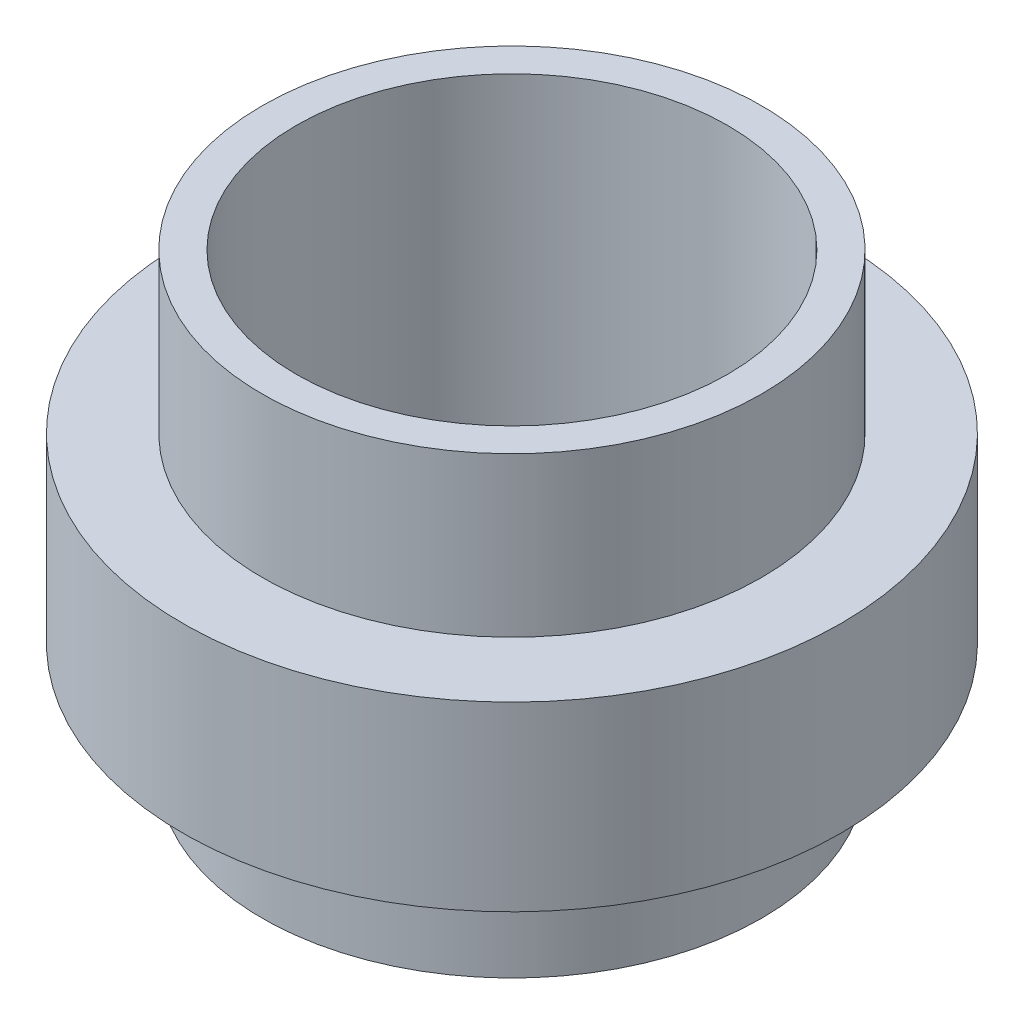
ISO-10303-21;
HEADER;
FILE_DESCRIPTION(('STEP AP214'),'2;1');
FILE_NAME('part.step','',(''),(''),'','','');
FILE_SCHEMA(('AUTOMOTIVE_DESIGN { 1 0 10303 214 1 1 1 1 }'));
ENDSEC;
DATA;
#1=APPLICATION_CONTEXT('core data for automotive mechanical design processes');
#2=APPLICATION_PROTOCOL_DEFINITION('international standard','automotive_design',2000,#1);
#3=PRODUCT_CONTEXT('',#1,'mechanical');
#4=PRODUCT('Part','Part','',(#3));
#5=PRODUCT_RELATED_PRODUCT_CATEGORY('part','',(#4));
#6=PRODUCT_DEFINITION_FORMATION('','',#4);
#7=PRODUCT_DEFINITION_CONTEXT('part definition',#1,'design');
#8=PRODUCT_DEFINITION('design','',#6,#7);
#9=PRODUCT_DEFINITION_SHAPE('','',#8);
#10=(LENGTH_UNIT() NAMED_UNIT(*) SI_UNIT(.MILLI.,.METRE.));
#11=(NAMED_UNIT(*) PLANE_ANGLE_UNIT() SI_UNIT($,.RADIAN.));
#12=(NAMED_UNIT(*) SI_UNIT($,.STERADIAN.) SOLID_ANGLE_UNIT());
#13=UNCERTAINTY_MEASURE_WITH_UNIT(LENGTH_MEASURE(1.E-05),#10,'distance_accuracy_value','');
#14=(GEOMETRIC_REPRESENTATION_CONTEXT(3) GLOBAL_UNCERTAINTY_ASSIGNED_CONTEXT((#13)) GLOBAL_UNIT_ASSIGNED_CONTEXT((#10,
#11,#12)) REPRESENTATION_CONTEXT('',''));
#15=CARTESIAN_POINT('',(0.,0.,0.));
#16=DIRECTION('',(0.,0.,1.));
#17=DIRECTION('',(1.,0.,0.));
#18=AXIS2_PLACEMENT_3D('',#15,#16,#17);
#19=CARTESIAN_POINT('',(0.,0.,0.));
#20=DIRECTION('',(0.,-1.,0.));
#21=DIRECTION('',(1.,0.,0.));
#22=AXIS2_PLACEMENT_3D('',#19,#20,#21);
#23=CYLINDRICAL_SURFACE('',#22,14.5);
#24=CARTESIAN_POINT('',(0.,4.00000000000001,0.));
#25=DIRECTION('',(0.,-1.,0.));
#26=DIRECTION('',(1.,0.,0.));
#27=AXIS2_PLACEMENT_3D('',#24,#25,#26);
#28=CIRCLE('',#27,14.5);
#29=CARTESIAN_POINT('',(14.5,4.,0.));
#30=VERTEX_POINT('',#29);
#31=EDGE_CURVE('E16',#30,#30,#28,.F.);
#32=ORIENTED_EDGE('',*,*,#31,.F.);
#33=EDGE_LOOP('',(#32));
#34=FACE_BOUND('',#33,.T.);
#35=CARTESIAN_POINT('',(0.,-3.99999999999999,0.));
#36=DIRECTION('',(0.,-1.,0.));
#37=DIRECTION('',(1.,0.,0.));
#38=AXIS2_PLACEMENT_3D('',#35,#36,#37);
#39=CIRCLE('',#38,14.5);
#40=CARTESIAN_POINT('',(14.5,-4.,0.));
#41=VERTEX_POINT('',#40);
#42=EDGE_CURVE('E38',#41,#41,#39,.T.);
#43=ORIENTED_EDGE('',*,*,#42,.F.);
#44=EDGE_LOOP('',(#43));
#45=FACE_BOUND('',#44,.T.);
#46=ADVANCED_FACE('F13',(#34,#45),#23,.T.);
#47=CARTESIAN_POINT('',(12.75,4.,0.));
#48=DIRECTION('',(0.,1.,0.));
#49=DIRECTION('',(0.,0.,1.));
#50=AXIS2_PLACEMENT_3D('',#47,#48,#49);
#51=PLANE('',#50);
#52=CARTESIAN_POINT('',(0.,4.00000000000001,0.));
#53=DIRECTION('',(0.,-1.,0.));
#54=DIRECTION('',(1.,0.,0.));
#55=AXIS2_PLACEMENT_3D('',#52,#53,#54);
#56=CIRCLE('',#55,11.);
#57=CARTESIAN_POINT('',(11.,4.,0.));
#58=VERTEX_POINT('',#57);
#59=EDGE_CURVE('E36',#58,#58,#56,.F.);
#60=ORIENTED_EDGE('',*,*,#59,.F.);
#61=EDGE_LOOP('',(#60));
#62=FACE_BOUND('',#61,.T.);
#63=ORIENTED_EDGE('',*,*,#31,.T.);
#64=EDGE_LOOP('',(#63));
#65=FACE_BOUND('',#64,.T.);
#66=ADVANCED_FACE('F45',(#62,#65),#51,.T.);
#67=CARTESIAN_POINT('',(12.75,-4.,0.));
#68=DIRECTION('',(0.,-1.,0.));
#69=DIRECTION('',(0.,0.,-1.));
#70=AXIS2_PLACEMENT_3D('',#67,#68,#69);
#71=PLANE('',#70);
#72=CARTESIAN_POINT('',(0.,-3.99999999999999,0.));
#73=DIRECTION('',(0.,-1.,0.));
#74=DIRECTION('',(1.,0.,0.));
#75=AXIS2_PLACEMENT_3D('',#72,#73,#74);
#76=CIRCLE('',#75,11.);
#77=CARTESIAN_POINT('',(11.,-4.,0.));
#78=VERTEX_POINT('',#77);
#79=EDGE_CURVE('E33',#78,#78,#76,.T.);
#80=ORIENTED_EDGE('',*,*,#79,.F.);
#81=EDGE_LOOP('',(#80));
#82=FACE_BOUND('',#81,.T.);
#83=ORIENTED_EDGE('',*,*,#42,.T.);
#84=EDGE_LOOP('',(#83));
#85=FACE_BOUND('',#84,.T.);
#86=ADVANCED_FACE('F53',(#82,#85),#71,.T.);
#87=CARTESIAN_POINT('',(0.,7.50000000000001,0.));
#88=DIRECTION('',(0.,-1.,0.));
#89=DIRECTION('',(1.,0.,0.));
#90=AXIS2_PLACEMENT_3D('',#87,#88,#89);
#91=CYLINDRICAL_SURFACE('',#90,11.);
#92=CARTESIAN_POINT('',(0.,11.,0.));
#93=DIRECTION('',(0.,-1.,0.));
#94=DIRECTION('',(1.,0.,0.));
#95=AXIS2_PLACEMENT_3D('',#92,#93,#94);
#96=CIRCLE('',#95,11.);
#97=CARTESIAN_POINT('',(11.,11.,0.));
#98=VERTEX_POINT('',#97);
#99=EDGE_CURVE('E30',#98,#98,#96,.F.);
#100=ORIENTED_EDGE('',*,*,#99,.F.);
#101=EDGE_LOOP('',(#100));
#102=FACE_BOUND('',#101,.T.);
#103=ORIENTED_EDGE('',*,*,#59,.T.);
#104=EDGE_LOOP('',(#103));
#105=FACE_BOUND('',#104,.T.);
#106=ADVANCED_FACE('F73',(#102,#105),#91,.T.);
#107=CARTESIAN_POINT('',(0.,-6.49999999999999,0.));
#108=DIRECTION('',(0.,-1.,0.));
#109=DIRECTION('',(1.,0.,0.));
#110=AXIS2_PLACEMENT_3D('',#107,#108,#109);
#111=CYLINDRICAL_SURFACE('',#110,11.);
#112=ORIENTED_EDGE('',*,*,#79,.T.);
#113=EDGE_LOOP('',(#112));
#114=FACE_BOUND('',#113,.T.);
#115=CARTESIAN_POINT('',(0.,-8.99999999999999,0.));
#116=DIRECTION('',(0.,-1.,0.));
#117=DIRECTION('',(1.,0.,0.));
#118=AXIS2_PLACEMENT_3D('',#115,#116,#117);
#119=CIRCLE('',#118,11.);
#120=CARTESIAN_POINT('',(11.,-9.00000000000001,0.));
#121=VERTEX_POINT('',#120);
#122=EDGE_CURVE('E25',#121,#121,#119,.T.);
#123=ORIENTED_EDGE('',*,*,#122,.F.);
#124=EDGE_LOOP('',(#123));
#125=FACE_BOUND('',#124,.T.);
#126=ADVANCED_FACE('F69',(#114,#125),#111,.T.);
#127=CARTESIAN_POINT('',(10.25,11.,0.));
#128=DIRECTION('',(0.,1.,0.));
#129=DIRECTION('',(0.,0.,1.));
#130=AXIS2_PLACEMENT_3D('',#127,#128,#129);
#131=PLANE('',#130);
#132=CARTESIAN_POINT('',(0.,11.,0.));
#133=DIRECTION('',(0.,-1.,0.));
#134=DIRECTION('',(1.,0.,0.));
#135=AXIS2_PLACEMENT_3D('',#132,#133,#134);
#136=CIRCLE('',#135,9.5);
#137=CARTESIAN_POINT('',(9.50000000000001,11.,0.));
#138=VERTEX_POINT('',#137);
#139=EDGE_CURVE('E20',#138,#138,#136,.T.);
#140=ORIENTED_EDGE('',*,*,#139,.T.);
#141=EDGE_LOOP('',(#140));
#142=FACE_BOUND('',#141,.T.);
#143=ORIENTED_EDGE('',*,*,#99,.T.);
#144=EDGE_LOOP('',(#143));
#145=FACE_BOUND('',#144,.T.);
#146=ADVANCED_FACE('F63',(#142,#145),#131,.T.);
#147=CARTESIAN_POINT('',(10.25,-9.00000000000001,0.));
#148=DIRECTION('',(0.,-1.,0.));
#149=DIRECTION('',(0.,0.,-1.));
#150=AXIS2_PLACEMENT_3D('',#147,#148,#149);
#151=PLANE('',#150);
#152=CARTESIAN_POINT('',(0.,-9.,0.));
#153=DIRECTION('',(0.,-1.,0.));
#154=DIRECTION('',(1.,0.,0.));
#155=AXIS2_PLACEMENT_3D('',#152,#153,#154);
#156=CIRCLE('',#155,9.5);
#157=CARTESIAN_POINT('',(9.49999999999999,-9.00000000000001,0.));
#158=VERTEX_POINT('',#157);
#159=EDGE_CURVE('E9',#158,#158,#156,.F.);
#160=ORIENTED_EDGE('',*,*,#159,.T.);
#161=EDGE_LOOP('',(#160));
#162=FACE_BOUND('',#161,.T.);
#163=ORIENTED_EDGE('',*,*,#122,.T.);
#164=EDGE_LOOP('',(#163));
#165=FACE_BOUND('',#164,.T.);
#166=ADVANCED_FACE('F57',(#162,#165),#151,.T.);
#167=CARTESIAN_POINT('',(0.,1.,0.));
#168=DIRECTION('',(0.,-1.,0.));
#169=DIRECTION('',(1.,0.,0.));
#170=AXIS2_PLACEMENT_3D('',#167,#168,#169);
#171=CYLINDRICAL_SURFACE('',#170,9.5);
#172=ORIENTED_EDGE('',*,*,#159,.F.);
#173=EDGE_LOOP('',(#172));
#174=FACE_BOUND('',#173,.T.);
#175=ORIENTED_EDGE('',*,*,#139,.F.);
#176=EDGE_LOOP('',(#175));
#177=FACE_BOUND('',#176,.T.);
#178=ADVANCED_FACE('F55',(#174,#177),#171,.F.);
#179=CLOSED_SHELL('',(#46,#66,#86,#106,#126,#146,#166,#178));
#180=MANIFOLD_SOLID_BREP('B1',#179);
#181=ADVANCED_BREP_SHAPE_REPRESENTATION('',(#18,#180),#14);
#182=SHAPE_DEFINITION_REPRESENTATION(#9,#181);
ENDSEC;
END-ISO-10303-21;
